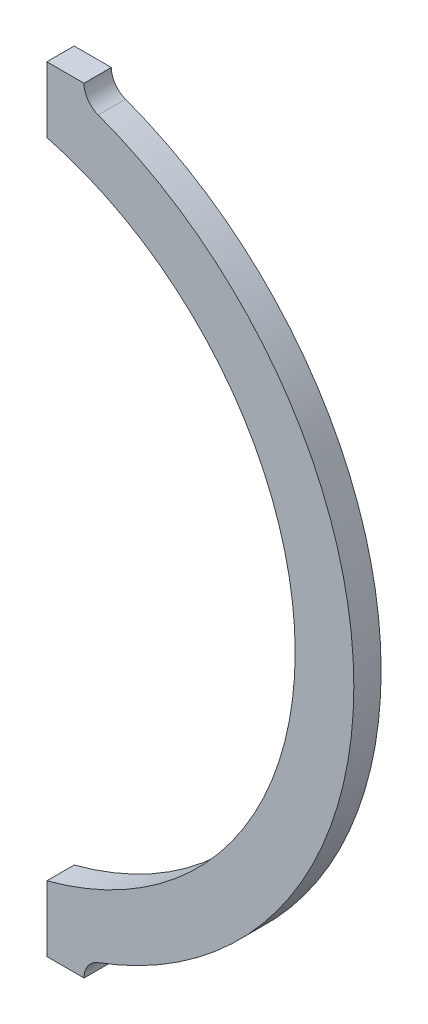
ISO-10303-21;
HEADER;
FILE_DESCRIPTION(('STEP AP214'),'2;1');
FILE_NAME('part.step','',(''),(''),'','','');
FILE_SCHEMA(('AUTOMOTIVE_DESIGN { 1 0 10303 214 1 1 1 1 }'));
ENDSEC;
DATA;
#1=APPLICATION_CONTEXT('core data for automotive mechanical design processes');
#2=APPLICATION_PROTOCOL_DEFINITION('international standard','automotive_design',2000,#1);
#3=PRODUCT_CONTEXT('',#1,'mechanical');
#4=PRODUCT('Part','Part','',(#3));
#5=PRODUCT_RELATED_PRODUCT_CATEGORY('part','',(#4));
#6=PRODUCT_DEFINITION_FORMATION('','',#4);
#7=PRODUCT_DEFINITION_CONTEXT('part definition',#1,'design');
#8=PRODUCT_DEFINITION('design','',#6,#7);
#9=PRODUCT_DEFINITION_SHAPE('','',#8);
#10=(LENGTH_UNIT() NAMED_UNIT(*) SI_UNIT(.MILLI.,.METRE.));
#11=(NAMED_UNIT(*) PLANE_ANGLE_UNIT() SI_UNIT($,.RADIAN.));
#12=(NAMED_UNIT(*) SI_UNIT($,.STERADIAN.) SOLID_ANGLE_UNIT());
#13=UNCERTAINTY_MEASURE_WITH_UNIT(LENGTH_MEASURE(1.E-05),#10,'distance_accuracy_value','');
#14=(GEOMETRIC_REPRESENTATION_CONTEXT(3) GLOBAL_UNCERTAINTY_ASSIGNED_CONTEXT((#13)) GLOBAL_UNIT_ASSIGNED_CONTEXT((#10,
#11,#12)) REPRESENTATION_CONTEXT('',''));
#15=CARTESIAN_POINT('',(0.,0.,0.));
#16=DIRECTION('',(0.,0.,1.));
#17=DIRECTION('',(1.,0.,0.));
#18=AXIS2_PLACEMENT_3D('',#15,#16,#17);
#19=CARTESIAN_POINT('',(0.,0.,2.615));
#20=DIRECTION('',(0.,0.,-1.));
#21=DIRECTION('',(-1.,0.,0.));
#22=AXIS2_PLACEMENT_3D('',#19,#20,#21);
#23=CYLINDRICAL_SURFACE('',#22,63.7588631);
#24=CARTESIAN_POINT('',(0.,0.,-2.615));
#25=DIRECTION('',(0.,0.,-1.));
#26=DIRECTION('',(1.,0.,0.));
#27=AXIS2_PLACEMENT_3D('',#24,#25,#26);
#28=CIRCLE('',#27,63.7588631);
#29=CARTESIAN_POINT('',(16.175,61.673024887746,-2.615));
#30=VERTEX_POINT('',#29);
#31=CARTESIAN_POINT('',(16.175,-61.673024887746,-2.615));
#32=VERTEX_POINT('',#31);
#33=EDGE_CURVE('E127',#30,#32,#28,.T.);
#34=ORIENTED_EDGE('',*,*,#33,.T.);
#35=DIRECTION('',(0.,0.,-1.));
#36=VECTOR('',#35,1.);
#37=CARTESIAN_POINT('',(16.175,-61.673024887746,2.615));
#38=LINE('',#37,#36);
#39=CARTESIAN_POINT('',(16.175,-61.673024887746,2.615));
#40=VERTEX_POINT('',#39);
#41=EDGE_CURVE('E11',#40,#32,#38,.T.);
#42=ORIENTED_EDGE('',*,*,#41,.F.);
#43=CARTESIAN_POINT('',(0.,0.,2.615));
#44=DIRECTION('',(0.,0.,-1.));
#45=DIRECTION('',(1.,0.,0.));
#46=AXIS2_PLACEMENT_3D('',#43,#44,#45);
#47=CIRCLE('',#46,63.7588631);
#48=CARTESIAN_POINT('',(16.175,61.673024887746,2.615));
#49=VERTEX_POINT('',#48);
#50=EDGE_CURVE('E141',#49,#40,#47,.T.);
#51=ORIENTED_EDGE('',*,*,#50,.F.);
#52=DIRECTION('',(0.,0.,-1.));
#53=VECTOR('',#52,1.);
#54=CARTESIAN_POINT('',(16.175,61.673024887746,2.615));
#55=LINE('',#54,#53);
#56=EDGE_CURVE('E123',#49,#30,#55,.T.);
#57=ORIENTED_EDGE('',*,*,#56,.T.);
#58=EDGE_LOOP('',(#34,#42,#51,#57));
#59=FACE_BOUND('',#58,.T.);
#60=ADVANCED_FACE('F31',(#59),#23,.F.);
#61=CARTESIAN_POINT('',(16.175,-61.673024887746,2.615));
#62=DIRECTION('',(1.,0.,0.));
#63=DIRECTION('',(0.,0.,-1.));
#64=AXIS2_PLACEMENT_3D('',#61,#62,#63);
#65=PLANE('',#64);
#66=DIRECTION('',(0.,-1.,0.));
#67=VECTOR('',#66,1.);
#68=CARTESIAN_POINT('',(16.175,-61.673024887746,-2.615));
#69=LINE('',#68,#67);
#70=CARTESIAN_POINT('',(16.175,-74.251052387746,-2.615));
#71=VERTEX_POINT('',#70);
#72=EDGE_CURVE('E130',#32,#71,#69,.T.);
#73=ORIENTED_EDGE('',*,*,#72,.T.);
#74=DIRECTION('',(0.,0.,-1.));
#75=VECTOR('',#74,1.);
#76=CARTESIAN_POINT('',(16.175,-74.251052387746,2.615));
#77=LINE('',#76,#75);
#78=CARTESIAN_POINT('',(16.175,-74.251052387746,2.615));
#79=VERTEX_POINT('',#78);
#80=EDGE_CURVE('E39',#79,#71,#77,.T.);
#81=ORIENTED_EDGE('',*,*,#80,.F.);
#82=DIRECTION('',(0.,-1.,0.));
#83=VECTOR('',#82,1.);
#84=CARTESIAN_POINT('',(16.175,-61.673024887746,2.615));
#85=LINE('',#84,#83);
#86=EDGE_CURVE('E90',#40,#79,#85,.T.);
#87=ORIENTED_EDGE('',*,*,#86,.F.);
#88=ORIENTED_EDGE('',*,*,#41,.T.);
#89=EDGE_LOOP('',(#73,#81,#87,#88));
#90=FACE_BOUND('',#89,.T.);
#91=ADVANCED_FACE('F176',(#90),#65,.F.);
#92=CARTESIAN_POINT('',(16.175,-74.251052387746,2.615));
#93=DIRECTION('',(0.,1.,0.));
#94=DIRECTION('',(0.,0.,1.));
#95=AXIS2_PLACEMENT_3D('',#92,#93,#94);
#96=PLANE('',#95);
#97=DIRECTION('',(1.,0.,0.));
#98=VECTOR('',#97,1.);
#99=CARTESIAN_POINT('',(16.175,-74.251052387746,-2.615));
#100=LINE('',#99,#98);
#101=CARTESIAN_POINT('',(23.295,-74.251052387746,-2.615));
#102=VERTEX_POINT('',#101);
#103=EDGE_CURVE('E132',#71,#102,#100,.T.);
#104=ORIENTED_EDGE('',*,*,#103,.T.);
#105=DIRECTION('',(0.,0.,-1.));
#106=VECTOR('',#105,1.);
#107=CARTESIAN_POINT('',(23.295,-74.251052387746,2.615));
#108=LINE('',#107,#106);
#109=CARTESIAN_POINT('',(23.295,-74.251052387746,2.615));
#110=VERTEX_POINT('',#109);
#111=EDGE_CURVE('E148',#110,#102,#108,.T.);
#112=ORIENTED_EDGE('',*,*,#111,.F.);
#113=DIRECTION('',(1.,0.,0.));
#114=VECTOR('',#113,1.);
#115=CARTESIAN_POINT('',(16.175,-74.251052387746,2.615));
#116=LINE('',#115,#114);
#117=EDGE_CURVE('E156',#79,#110,#116,.T.);
#118=ORIENTED_EDGE('',*,*,#117,.F.);
#119=ORIENTED_EDGE('',*,*,#80,.T.);
#120=EDGE_LOOP('',(#104,#112,#118,#119));
#121=FACE_BOUND('',#120,.T.);
#122=ADVANCED_FACE('F154',(#121),#96,.F.);
#123=CARTESIAN_POINT('',(27.4616744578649,-74.251052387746,2.615));
#124=DIRECTION('',(0.,0.,-1.));
#125=DIRECTION('',(-1.,0.,0.));
#126=AXIS2_PLACEMENT_3D('',#123,#124,#125);
#127=CYLINDRICAL_SURFACE('',#126,4.16667445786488);
#128=CARTESIAN_POINT('',(27.4616744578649,-74.251052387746,-2.615));
#129=DIRECTION('',(0.,0.,-1.));
#130=DIRECTION('',(-1.,0.,0.));
#131=AXIS2_PLACEMENT_3D('',#128,#129,#130);
#132=CIRCLE('',#131,4.16667445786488);
#133=CARTESIAN_POINT('',(26.0163206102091,-70.3430953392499,-2.615));
#134=VERTEX_POINT('',#133);
#135=EDGE_CURVE('E134',#102,#134,#132,.T.);
#136=ORIENTED_EDGE('',*,*,#135,.T.);
#137=DIRECTION('',(0.,0.,-1.));
#138=VECTOR('',#137,1.);
#139=CARTESIAN_POINT('',(26.0163206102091,-70.3430953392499,2.615));
#140=LINE('',#139,#138);
#141=CARTESIAN_POINT('',(26.0163206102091,-70.3430953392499,2.615));
#142=VERTEX_POINT('',#141);
#143=EDGE_CURVE('E145',#142,#134,#140,.T.);
#144=ORIENTED_EDGE('',*,*,#143,.F.);
#145=CARTESIAN_POINT('',(27.4616744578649,-74.251052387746,2.615));
#146=DIRECTION('',(0.,0.,-1.));
#147=DIRECTION('',(-1.,0.,0.));
#148=AXIS2_PLACEMENT_3D('',#145,#146,#147);
#149=CIRCLE('',#148,4.16667445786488);
#150=EDGE_CURVE('E168',#110,#142,#149,.T.);
#151=ORIENTED_EDGE('',*,*,#150,.F.);
#152=ORIENTED_EDGE('',*,*,#111,.T.);
#153=EDGE_LOOP('',(#136,#144,#151,#152));
#154=FACE_BOUND('',#153,.T.);
#155=ADVANCED_FACE('F164',(#154),#127,.F.);
#156=CARTESIAN_POINT('',(0.,0.,2.615));
#157=DIRECTION('',(0.,0.,-1.));
#158=DIRECTION('',(-1.,0.,0.));
#159=AXIS2_PLACEMENT_3D('',#156,#157,#158);
#160=CYLINDRICAL_SURFACE('',#159,75.);
#161=CARTESIAN_POINT('',(0.,0.,-2.615));
#162=DIRECTION('',(0.,0.,1.));
#163=DIRECTION('',(1.,0.,0.));
#164=AXIS2_PLACEMENT_3D('',#161,#162,#163);
#165=CIRCLE('',#164,75.);
#166=CARTESIAN_POINT('',(26.0163206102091,70.34309533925,-2.615));
#167=VERTEX_POINT('',#166);
#168=EDGE_CURVE('E136',#134,#167,#165,.T.);
#169=ORIENTED_EDGE('',*,*,#168,.T.);
#170=DIRECTION('',(0.,0.,-1.));
#171=VECTOR('',#170,1.);
#172=CARTESIAN_POINT('',(26.0163206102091,70.34309533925,2.615));
#173=LINE('',#172,#171);
#174=CARTESIAN_POINT('',(26.0163206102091,70.34309533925,2.615));
#175=VERTEX_POINT('',#174);
#176=EDGE_CURVE('E118',#175,#167,#173,.T.);
#177=ORIENTED_EDGE('',*,*,#176,.F.);
#178=CARTESIAN_POINT('',(0.,0.,2.615));
#179=DIRECTION('',(0.,0.,1.));
#180=DIRECTION('',(1.,0.,0.));
#181=AXIS2_PLACEMENT_3D('',#178,#179,#180);
#182=CIRCLE('',#181,75.);
#183=EDGE_CURVE('E109',#142,#175,#182,.T.);
#184=ORIENTED_EDGE('',*,*,#183,.F.);
#185=ORIENTED_EDGE('',*,*,#143,.T.);
#186=EDGE_LOOP('',(#169,#177,#184,#185));
#187=FACE_BOUND('',#186,.T.);
#188=ADVANCED_FACE('F167',(#187),#160,.T.);
#189=CARTESIAN_POINT('',(27.4616744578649,74.251052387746,2.615));
#190=DIRECTION('',(0.,0.,-1.));
#191=DIRECTION('',(-1.,0.,0.));
#192=AXIS2_PLACEMENT_3D('',#189,#190,#191);
#193=CYLINDRICAL_SURFACE('',#192,4.16667445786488);
#194=CARTESIAN_POINT('',(27.4616744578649,74.251052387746,-2.615));
#195=DIRECTION('',(0.,0.,-1.));
#196=DIRECTION('',(1.,0.,0.));
#197=AXIS2_PLACEMENT_3D('',#194,#195,#196);
#198=CIRCLE('',#197,4.16667445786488);
#199=CARTESIAN_POINT('',(23.295,74.251052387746,-2.615));
#200=VERTEX_POINT('',#199);
#201=EDGE_CURVE('E117',#167,#200,#198,.T.);
#202=ORIENTED_EDGE('',*,*,#201,.T.);
#203=DIRECTION('',(0.,0.,-1.));
#204=VECTOR('',#203,1.);
#205=CARTESIAN_POINT('',(23.295,74.251052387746,2.615));
#206=LINE('',#205,#204);
#207=CARTESIAN_POINT('',(23.295,74.251052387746,2.615));
#208=VERTEX_POINT('',#207);
#209=EDGE_CURVE('E114',#208,#200,#206,.T.);
#210=ORIENTED_EDGE('',*,*,#209,.F.);
#211=CARTESIAN_POINT('',(27.4616744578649,74.251052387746,2.615));
#212=DIRECTION('',(0.,0.,-1.));
#213=DIRECTION('',(1.,0.,0.));
#214=AXIS2_PLACEMENT_3D('',#211,#212,#213);
#215=CIRCLE('',#214,4.16667445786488);
#216=EDGE_CURVE('E103',#175,#208,#215,.T.);
#217=ORIENTED_EDGE('',*,*,#216,.F.);
#218=ORIENTED_EDGE('',*,*,#176,.T.);
#219=EDGE_LOOP('',(#202,#210,#217,#218));
#220=FACE_BOUND('',#219,.T.);
#221=ADVANCED_FACE('F115',(#220),#193,.F.);
#222=CARTESIAN_POINT('',(16.175,74.251052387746,2.615));
#223=DIRECTION('',(0.,-1.,0.));
#224=DIRECTION('',(0.,0.,-1.));
#225=AXIS2_PLACEMENT_3D('',#222,#223,#224);
#226=PLANE('',#225);
#227=DIRECTION('',(-1.,0.,0.));
#228=VECTOR('',#227,1.);
#229=CARTESIAN_POINT('',(16.175,74.251052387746,-2.615));
#230=LINE('',#229,#228);
#231=CARTESIAN_POINT('',(16.175,74.251052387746,-2.615));
#232=VERTEX_POINT('',#231);
#233=EDGE_CURVE('E76',#200,#232,#230,.T.);
#234=ORIENTED_EDGE('',*,*,#233,.T.);
#235=DIRECTION('',(0.,0.,-1.));
#236=VECTOR('',#235,1.);
#237=CARTESIAN_POINT('',(16.175,74.251052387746,2.615));
#238=LINE('',#237,#236);
#239=CARTESIAN_POINT('',(16.175,74.251052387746,2.615));
#240=VERTEX_POINT('',#239);
#241=EDGE_CURVE('E119',#240,#232,#238,.T.);
#242=ORIENTED_EDGE('',*,*,#241,.F.);
#243=DIRECTION('',(-1.,0.,0.));
#244=VECTOR('',#243,1.);
#245=CARTESIAN_POINT('',(16.175,74.251052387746,2.615));
#246=LINE('',#245,#244);
#247=EDGE_CURVE('E107',#208,#240,#246,.T.);
#248=ORIENTED_EDGE('',*,*,#247,.F.);
#249=ORIENTED_EDGE('',*,*,#209,.T.);
#250=EDGE_LOOP('',(#234,#242,#248,#249));
#251=FACE_BOUND('',#250,.T.);
#252=ADVANCED_FACE('F121',(#251),#226,.F.);
#253=CARTESIAN_POINT('',(16.175,61.673024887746,2.615));
#254=DIRECTION('',(1.,0.,0.));
#255=DIRECTION('',(0.,1.,0.));
#256=AXIS2_PLACEMENT_3D('',#253,#254,#255);
#257=PLANE('',#256);
#258=DIRECTION('',(0.,-1.,0.));
#259=VECTOR('',#258,1.);
#260=CARTESIAN_POINT('',(16.175,61.673024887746,-2.615));
#261=LINE('',#260,#259);
#262=EDGE_CURVE('E82',#232,#30,#261,.T.);
#263=ORIENTED_EDGE('',*,*,#262,.T.);
#264=ORIENTED_EDGE('',*,*,#56,.F.);
#265=DIRECTION('',(0.,-1.,0.));
#266=VECTOR('',#265,1.);
#267=CARTESIAN_POINT('',(16.175,61.673024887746,2.615));
#268=LINE('',#267,#266);
#269=EDGE_CURVE('E47',#240,#49,#268,.T.);
#270=ORIENTED_EDGE('',*,*,#269,.F.);
#271=ORIENTED_EDGE('',*,*,#241,.T.);
#272=EDGE_LOOP('',(#263,#264,#270,#271));
#273=FACE_BOUND('',#272,.T.);
#274=ADVANCED_FACE('F192',(#273),#257,.F.);
#275=CARTESIAN_POINT('',(0.,0.,2.615));
#276=DIRECTION('',(0.,0.,1.));
#277=DIRECTION('',(1.,0.,0.));
#278=AXIS2_PLACEMENT_3D('',#275,#276,#277);
#279=PLANE('',#278);
#280=ORIENTED_EDGE('',*,*,#50,.T.);
#281=ORIENTED_EDGE('',*,*,#86,.T.);
#282=ORIENTED_EDGE('',*,*,#117,.T.);
#283=ORIENTED_EDGE('',*,*,#150,.T.);
#284=ORIENTED_EDGE('',*,*,#183,.T.);
#285=ORIENTED_EDGE('',*,*,#216,.T.);
#286=ORIENTED_EDGE('',*,*,#247,.T.);
#287=ORIENTED_EDGE('',*,*,#269,.T.);
#288=EDGE_LOOP('',(#280,#281,#282,#283,#284,#285,#286,#287));
#289=FACE_BOUND('',#288,.T.);
#290=ADVANCED_FACE('F105',(#289),#279,.T.);
#291=CARTESIAN_POINT('',(0.,0.,-2.615));
#292=DIRECTION('',(0.,0.,1.));
#293=DIRECTION('',(1.,0.,0.));
#294=AXIS2_PLACEMENT_3D('',#291,#292,#293);
#295=PLANE('',#294);
#296=ORIENTED_EDGE('',*,*,#33,.F.);
#297=ORIENTED_EDGE('',*,*,#262,.F.);
#298=ORIENTED_EDGE('',*,*,#233,.F.);
#299=ORIENTED_EDGE('',*,*,#201,.F.);
#300=ORIENTED_EDGE('',*,*,#168,.F.);
#301=ORIENTED_EDGE('',*,*,#135,.F.);
#302=ORIENTED_EDGE('',*,*,#103,.F.);
#303=ORIENTED_EDGE('',*,*,#72,.F.);
#304=EDGE_LOOP('',(#296,#297,#298,#299,#300,#301,#302,#303));
#305=FACE_BOUND('',#304,.T.);
#306=ADVANCED_FACE('F160',(#305),#295,.F.);
#307=CLOSED_SHELL('',(#60,#91,#122,#155,#188,#221,#252,#274,#290,#306));
#308=MANIFOLD_SOLID_BREP('B2',#307);
#309=ADVANCED_BREP_SHAPE_REPRESENTATION('',(#18,#308),#14);
#310=SHAPE_DEFINITION_REPRESENTATION(#9,#309);
ENDSEC;
END-ISO-10303-21;
